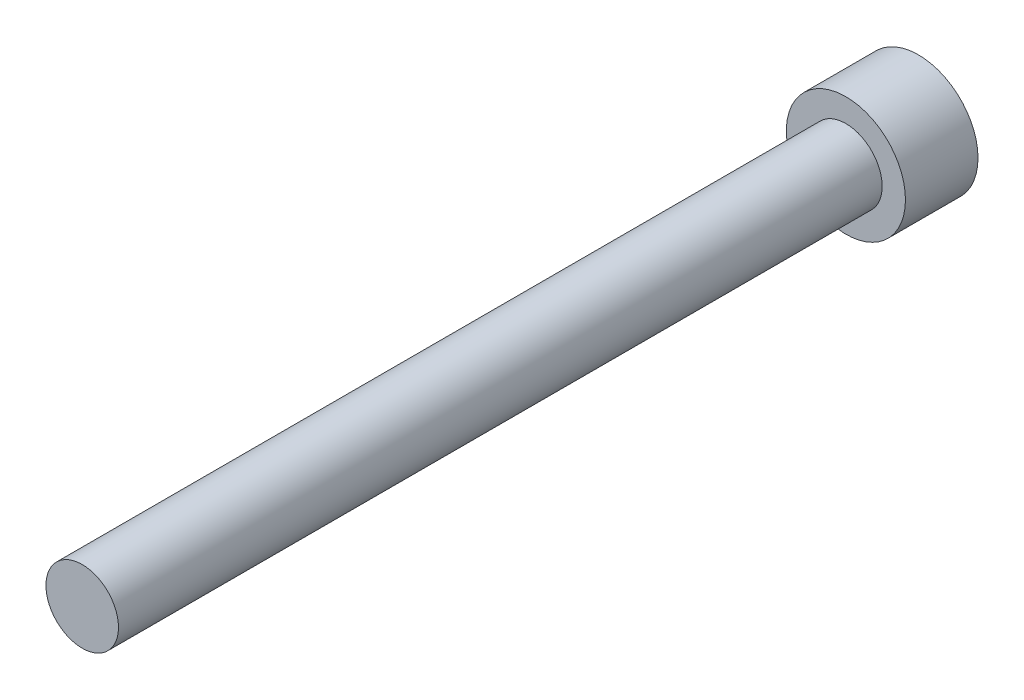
from build123d import *

# Parameters (mm, degrees)
HEX_2_DEPTH = 3.048


with BuildPart() as part:
    # Sketch6 → Revolve1 (revolve)
    with BuildSketch(Plane(origin=(0, 0, 0), x_dir=(0, 0, -1), z_dir=(1, 0, 0)), mode=Mode.PRIVATE) as revolve1_sk:
        Polygon((-50.8, 0), (-50.8, -2.413), (0, -2.413), (0, -3.9624), (4.826, -3.9624), (4.826, 0), align=None)
    revolve(revolve1_sk.sketch.rotate(Axis((0, 0, 50.8), (0, 0, -1)), 270), axis=Axis((0, 0, 50.8), (0, 0, -1)))

    # Sketch7 → HEX 2 (cut)
    with BuildSketch(Plane(origin=(0, 0, -4.826), x_dir=(-1, 0, 0), z_dir=(0, 0, -1))):
        Polygon((-1.9812, 1.143846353), (-1.9812, -1.143846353), (0, -2.287692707), (1.9812, -1.143846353), (1.9812, 1.143846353), (0, 2.287692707), align=None)
    extrude(amount=-HEX_2_DEPTH, mode=Mode.SUBTRACT)


solid = part.part
